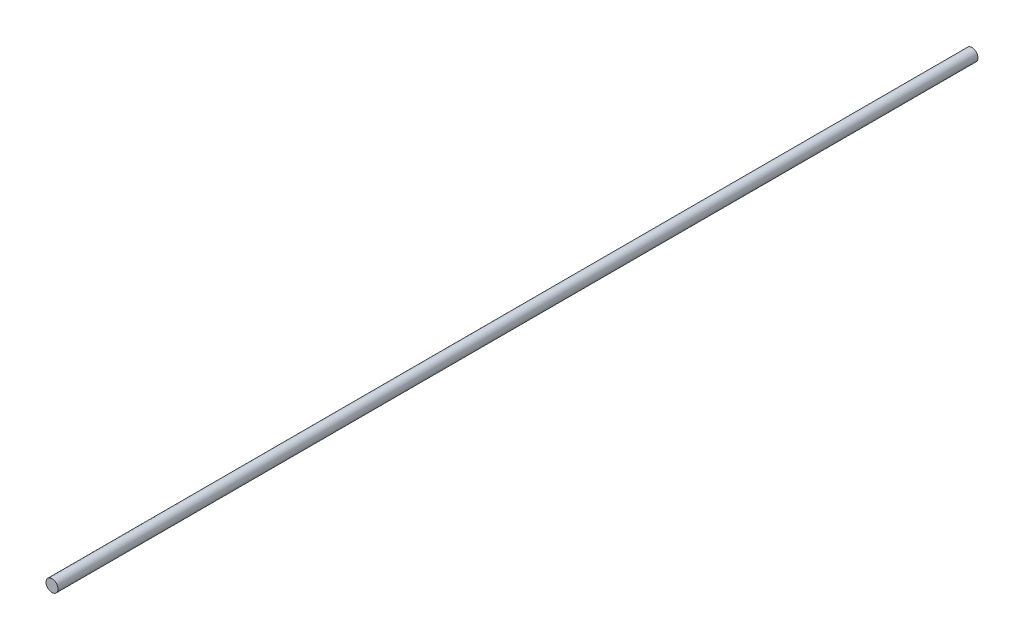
ISO-10303-21;
HEADER;
FILE_DESCRIPTION(('STEP AP214'),'2;1');
FILE_NAME('part.step','',(''),(''),'','','');
FILE_SCHEMA(('AUTOMOTIVE_DESIGN { 1 0 10303 214 1 1 1 1 }'));
ENDSEC;
DATA;
#1=APPLICATION_CONTEXT('core data for automotive mechanical design processes');
#2=APPLICATION_PROTOCOL_DEFINITION('international standard','automotive_design',2000,#1);
#3=PRODUCT_CONTEXT('',#1,'mechanical');
#4=PRODUCT('Part','Part','',(#3));
#5=PRODUCT_RELATED_PRODUCT_CATEGORY('part','',(#4));
#6=PRODUCT_DEFINITION_FORMATION('','',#4);
#7=PRODUCT_DEFINITION_CONTEXT('part definition',#1,'design');
#8=PRODUCT_DEFINITION('design','',#6,#7);
#9=PRODUCT_DEFINITION_SHAPE('','',#8);
#10=(LENGTH_UNIT() NAMED_UNIT(*) SI_UNIT(.MILLI.,.METRE.));
#11=(NAMED_UNIT(*) PLANE_ANGLE_UNIT() SI_UNIT($,.RADIAN.));
#12=(NAMED_UNIT(*) SI_UNIT($,.STERADIAN.) SOLID_ANGLE_UNIT());
#13=UNCERTAINTY_MEASURE_WITH_UNIT(LENGTH_MEASURE(1.E-05),#10,'distance_accuracy_value','');
#14=(GEOMETRIC_REPRESENTATION_CONTEXT(3) GLOBAL_UNCERTAINTY_ASSIGNED_CONTEXT((#13)) GLOBAL_UNIT_ASSIGNED_CONTEXT((#10,
#11,#12)) REPRESENTATION_CONTEXT('',''));
#15=CARTESIAN_POINT('',(0.,0.,0.));
#16=DIRECTION('',(0.,0.,1.));
#17=DIRECTION('',(1.,0.,0.));
#18=AXIS2_PLACEMENT_3D('',#15,#16,#17);
#19=CARTESIAN_POINT('',(0.,0.,-4600.));
#20=DIRECTION('',(0.,0.,1.));
#21=DIRECTION('',(1.,0.,0.));
#22=AXIS2_PLACEMENT_3D('',#19,#20,#21);
#23=CYLINDRICAL_SURFACE('',#22,30.);
#24=CARTESIAN_POINT('',(0.,0.,-4600.));
#25=DIRECTION('',(0.,0.,1.));
#26=DIRECTION('',(1.,0.,0.));
#27=AXIS2_PLACEMENT_3D('',#24,#25,#26);
#28=CIRCLE('',#27,30.);
#29=CARTESIAN_POINT('',(30.,0.,-4600.));
#30=VERTEX_POINT('',#29);
#31=EDGE_CURVE('E10',#30,#30,#28,.T.);
#32=ORIENTED_EDGE('',*,*,#31,.T.);
#33=EDGE_LOOP('',(#32));
#34=FACE_BOUND('',#33,.T.);
#35=CARTESIAN_POINT('',(0.,0.,0.));
#36=DIRECTION('',(0.,0.,1.));
#37=DIRECTION('',(1.,0.,0.));
#38=AXIS2_PLACEMENT_3D('',#35,#36,#37);
#39=CIRCLE('',#38,30.);
#40=CARTESIAN_POINT('',(30.,0.,0.));
#41=VERTEX_POINT('',#40);
#42=EDGE_CURVE('E40',#41,#41,#39,.T.);
#43=ORIENTED_EDGE('',*,*,#42,.F.);
#44=EDGE_LOOP('',(#43));
#45=FACE_BOUND('',#44,.T.);
#46=ADVANCED_FACE('F37',(#34,#45),#23,.T.);
#47=CARTESIAN_POINT('',(0.,0.,-4600.));
#48=DIRECTION('',(0.,0.,1.));
#49=DIRECTION('',(1.,0.,0.));
#50=AXIS2_PLACEMENT_3D('',#47,#48,#49);
#51=PLANE('',#50);
#52=ORIENTED_EDGE('',*,*,#31,.F.);
#53=EDGE_LOOP('',(#52));
#54=FACE_BOUND('',#53,.T.);
#55=ADVANCED_FACE('F54',(#54),#51,.F.);
#56=CARTESIAN_POINT('',(0.,0.,0.));
#57=DIRECTION('',(0.,0.,1.));
#58=DIRECTION('',(1.,0.,0.));
#59=AXIS2_PLACEMENT_3D('',#56,#57,#58);
#60=PLANE('',#59);
#61=ORIENTED_EDGE('',*,*,#42,.T.);
#62=EDGE_LOOP('',(#61));
#63=FACE_BOUND('',#62,.T.);
#64=ADVANCED_FACE('F51',(#63),#60,.T.);
#65=CLOSED_SHELL('',(#46,#55,#64));
#66=MANIFOLD_SOLID_BREP('B2',#65);
#67=ADVANCED_BREP_SHAPE_REPRESENTATION('',(#18,#66),#14);
#68=SHAPE_DEFINITION_REPRESENTATION(#9,#67);
ENDSEC;
END-ISO-10303-21;
